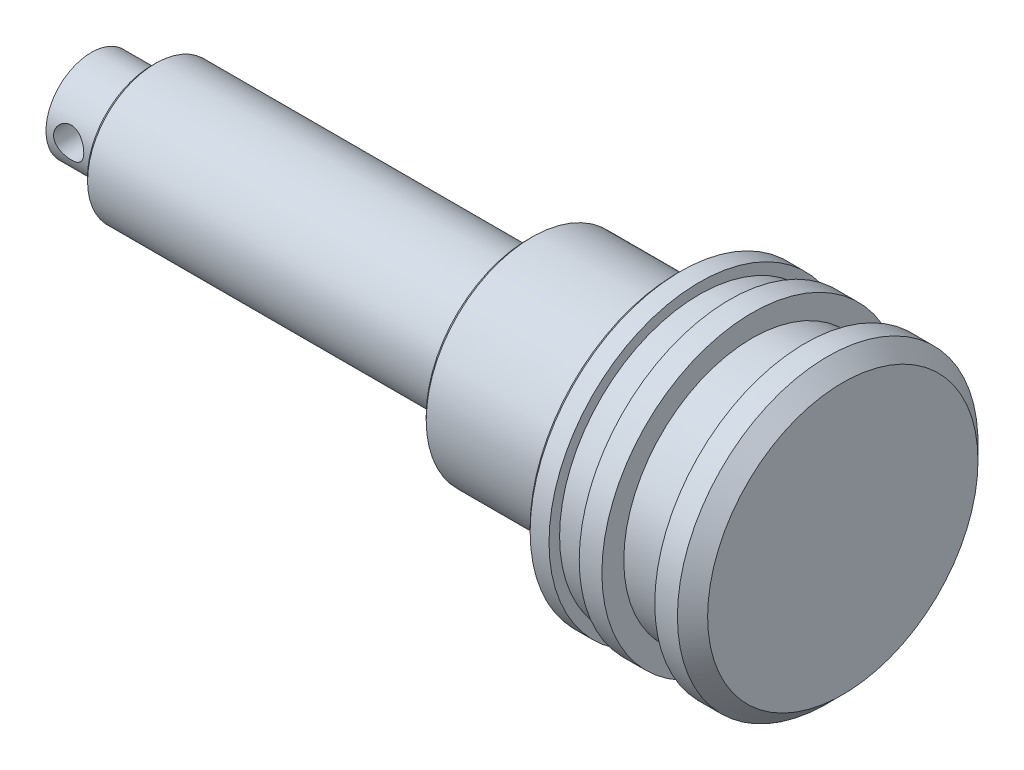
from build123d import *

# Parameters (mm, degrees)
ENL_V_MAT_EXTRU_1_DEPTH      = 106.811247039
ENL_V_MAT_EXTRU_1_DEPTH_BACK = 106.811247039
ESQUISSE2_R                  = 2


with BuildPart() as part:
    # Esquisse1 → R_volution1 (revolve)
    with BuildSketch(Plane.XY, mode=Mode.PRIVATE) as r_volution1_sk:
        Polygon((0, 0), (0, 17.9), (-2, 19.9), (-5, 19.9), (-5, 17), (-12, 17), (-12, 19.9), (-15, 19.9), (-15, 18.5), (-19, 18.5), (-19, 19.9), (-21.5, 19.9), (-22, 19.4), (-22, 14), (-41.16, 14), (-41.66, 13.5), (-41.66, 9), (-91, 9), (-91.5, 8.5), (-91.5, 6), (-99.5, 6), (-102, 0), align=None)
    revolve(r_volution1_sk.sketch.rotate(Axis((0, 0, 0), (1, 0, 0)), 90), axis=Axis((0, 0, 0), (1, 0, 0)))

    # Esquisse2 → Enl_v. mat.-Extru.1 (cut, two sides: drawn at the far end of the back side and taken through both)
    with BuildSketch(Plane.XY.offset(-ENL_V_MAT_EXTRU_1_DEPTH_BACK)):
        with Locations(Location((-96.5, 0, 0), (0, 0, 180))):
            Circle(ESQUISSE2_R)
    extrude(amount=ENL_V_MAT_EXTRU_1_DEPTH + ENL_V_MAT_EXTRU_1_DEPTH_BACK, mode=Mode.SUBTRACT)


solid = part.part
